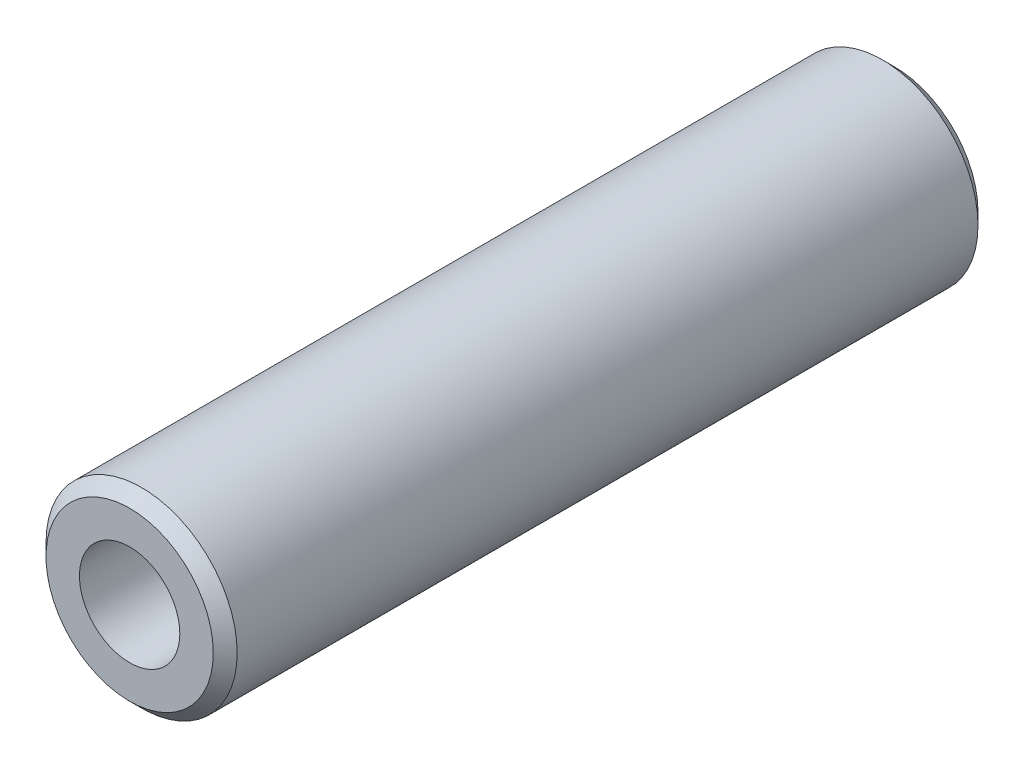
ISO-10303-21;
HEADER;
FILE_DESCRIPTION(('STEP AP214'),'2;1');
FILE_NAME('part.step','',(''),(''),'','','');
FILE_SCHEMA(('AUTOMOTIVE_DESIGN { 1 0 10303 214 1 1 1 1 }'));
ENDSEC;
DATA;
#1=APPLICATION_CONTEXT('core data for automotive mechanical design processes');
#2=APPLICATION_PROTOCOL_DEFINITION('international standard','automotive_design',2000,#1);
#3=PRODUCT_CONTEXT('',#1,'mechanical');
#4=PRODUCT('Part','Part','',(#3));
#5=PRODUCT_RELATED_PRODUCT_CATEGORY('part','',(#4));
#6=PRODUCT_DEFINITION_FORMATION('','',#4);
#7=PRODUCT_DEFINITION_CONTEXT('part definition',#1,'design');
#8=PRODUCT_DEFINITION('design','',#6,#7);
#9=PRODUCT_DEFINITION_SHAPE('','',#8);
#10=(LENGTH_UNIT() NAMED_UNIT(*) SI_UNIT(.MILLI.,.METRE.));
#11=(NAMED_UNIT(*) PLANE_ANGLE_UNIT() SI_UNIT($,.RADIAN.));
#12=(NAMED_UNIT(*) SI_UNIT($,.STERADIAN.) SOLID_ANGLE_UNIT());
#13=UNCERTAINTY_MEASURE_WITH_UNIT(LENGTH_MEASURE(1.E-05),#10,'distance_accuracy_value','');
#14=(GEOMETRIC_REPRESENTATION_CONTEXT(3) GLOBAL_UNCERTAINTY_ASSIGNED_CONTEXT((#13)) GLOBAL_UNIT_ASSIGNED_CONTEXT((#10,
#11,#12)) REPRESENTATION_CONTEXT('',''));
#15=CARTESIAN_POINT('',(0.,0.,0.));
#16=DIRECTION('',(0.,0.,1.));
#17=DIRECTION('',(1.,0.,0.));
#18=AXIS2_PLACEMENT_3D('',#15,#16,#17);
#19=CARTESIAN_POINT('',(0.,0.,16.));
#20=DIRECTION('',(0.,0.,-1.));
#21=DIRECTION('',(-1.,0.,0.));
#22=AXIS2_PLACEMENT_3D('',#19,#20,#21);
#23=CYLINDRICAL_SURFACE('',#22,4.);
#24=CARTESIAN_POINT('',(0.,0.,-15.5));
#25=DIRECTION('',(0.,0.,1.));
#26=DIRECTION('',(1.,0.,0.));
#27=AXIS2_PLACEMENT_3D('',#24,#25,#26);
#28=CIRCLE('',#27,4.);
#29=CARTESIAN_POINT('',(4.00000000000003,0.,-15.5));
#30=VERTEX_POINT('',#29);
#31=EDGE_CURVE('E56',#30,#30,#28,.T.);
#32=ORIENTED_EDGE('',*,*,#31,.T.);
#33=EDGE_LOOP('',(#32));
#34=FACE_BOUND('',#33,.T.);
#35=CARTESIAN_POINT('',(0.,0.,15.5));
#36=DIRECTION('',(0.,0.,1.));
#37=DIRECTION('',(1.,0.,0.));
#38=AXIS2_PLACEMENT_3D('',#35,#36,#37);
#39=CIRCLE('',#38,4.);
#40=CARTESIAN_POINT('',(4.,0.,15.5));
#41=VERTEX_POINT('',#40);
#42=EDGE_CURVE('E51',#41,#41,#39,.F.);
#43=ORIENTED_EDGE('',*,*,#42,.T.);
#44=EDGE_LOOP('',(#43));
#45=FACE_BOUND('',#44,.T.);
#46=ADVANCED_FACE('F30',(#34,#45),#23,.T.);
#47=CARTESIAN_POINT('',(0.,0.,16.));
#48=DIRECTION('',(0.,0.,1.));
#49=DIRECTION('',(1.,0.,0.));
#50=AXIS2_PLACEMENT_3D('',#47,#48,#49);
#51=PLANE('',#50);
#52=CARTESIAN_POINT('',(0.,0.,16.));
#53=DIRECTION('',(0.,0.,1.));
#54=DIRECTION('',(1.,0.,0.));
#55=AXIS2_PLACEMENT_3D('',#52,#53,#54);
#56=CIRCLE('',#55,2.1);
#57=CARTESIAN_POINT('',(2.1,0.,16.));
#58=VERTEX_POINT('',#57);
#59=EDGE_CURVE('E48',#58,#58,#56,.T.);
#60=ORIENTED_EDGE('',*,*,#59,.F.);
#61=EDGE_LOOP('',(#60));
#62=FACE_BOUND('',#61,.T.);
#63=CARTESIAN_POINT('',(0.,0.,16.));
#64=DIRECTION('',(0.,0.,1.));
#65=DIRECTION('',(1.,0.,0.));
#66=AXIS2_PLACEMENT_3D('',#63,#64,#65);
#67=CIRCLE('',#66,3.5);
#68=CARTESIAN_POINT('',(3.5,0.,16.));
#69=VERTEX_POINT('',#68);
#70=EDGE_CURVE('E11',#69,#69,#67,.T.);
#71=ORIENTED_EDGE('',*,*,#70,.T.);
#72=EDGE_LOOP('',(#71));
#73=FACE_BOUND('',#72,.T.);
#74=ADVANCED_FACE('F72',(#62,#73),#51,.T.);
#75=CARTESIAN_POINT('',(0.,0.,-16.));
#76=DIRECTION('',(0.,0.,1.));
#77=DIRECTION('',(1.,0.,0.));
#78=AXIS2_PLACEMENT_3D('',#75,#76,#77);
#79=PLANE('',#78);
#80=CARTESIAN_POINT('',(0.,0.,-16.));
#81=DIRECTION('',(0.,0.,1.));
#82=DIRECTION('',(1.,0.,0.));
#83=AXIS2_PLACEMENT_3D('',#80,#81,#82);
#84=CIRCLE('',#83,3.5);
#85=CARTESIAN_POINT('',(3.50000000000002,0.,-16.));
#86=VERTEX_POINT('',#85);
#87=EDGE_CURVE('E36',#86,#86,#84,.F.);
#88=ORIENTED_EDGE('',*,*,#87,.T.);
#89=EDGE_LOOP('',(#88));
#90=FACE_BOUND('',#89,.T.);
#91=ADVANCED_FACE('F61',(#90),#79,.F.);
#92=CARTESIAN_POINT('',(0.,0.,-15.5));
#93=DIRECTION('',(0.,0.,1.));
#94=DIRECTION('',(1.,0.,0.));
#95=AXIS2_PLACEMENT_3D('',#92,#93,#94);
#96=CONICAL_SURFACE('',#95,4.,0.785398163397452);
#97=ORIENTED_EDGE('',*,*,#87,.F.);
#98=EDGE_LOOP('',(#97));
#99=FACE_BOUND('',#98,.T.);
#100=ORIENTED_EDGE('',*,*,#31,.F.);
#101=EDGE_LOOP('',(#100));
#102=FACE_BOUND('',#101,.T.);
#103=ADVANCED_FACE('F63',(#99,#102),#96,.T.);
#104=CARTESIAN_POINT('',(0.,0.,16.));
#105=DIRECTION('',(0.,0.,-1.));
#106=DIRECTION('',(-1.,0.,0.));
#107=AXIS2_PLACEMENT_3D('',#104,#105,#106);
#108=CONICAL_SURFACE('',#107,3.5,0.785398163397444);
#109=ORIENTED_EDGE('',*,*,#42,.F.);
#110=EDGE_LOOP('',(#109));
#111=FACE_BOUND('',#110,.T.);
#112=ORIENTED_EDGE('',*,*,#70,.F.);
#113=EDGE_LOOP('',(#112));
#114=FACE_BOUND('',#113,.T.);
#115=ADVANCED_FACE('F66',(#111,#114),#108,.T.);
#116=CARTESIAN_POINT('',(0.,0.,16.));
#117=DIRECTION('',(0.,0.,1.));
#118=DIRECTION('',(1.,0.,0.));
#119=AXIS2_PLACEMENT_3D('',#116,#117,#118);
#120=CYLINDRICAL_SURFACE('',#119,2.1);
#121=CARTESIAN_POINT('',(0.,0.,5.6));
#122=DIRECTION('',(0.,0.,1.));
#123=DIRECTION('',(1.,0.,0.));
#124=AXIS2_PLACEMENT_3D('',#121,#122,#123);
#125=CIRCLE('',#124,2.1);
#126=CARTESIAN_POINT('',(2.1,0.,5.6));
#127=VERTEX_POINT('',#126);
#128=EDGE_CURVE('E46',#127,#127,#125,.T.);
#129=ORIENTED_EDGE('',*,*,#128,.F.);
#130=EDGE_LOOP('',(#129));
#131=FACE_BOUND('',#130,.T.);
#132=ORIENTED_EDGE('',*,*,#59,.T.);
#133=EDGE_LOOP('',(#132));
#134=FACE_BOUND('',#133,.T.);
#135=ADVANCED_FACE('F42',(#131,#134),#120,.F.);
#136=CARTESIAN_POINT('',(0.,0.,5.6));
#137=DIRECTION('',(0.,0.,1.));
#138=DIRECTION('',(1.,0.,0.));
#139=AXIS2_PLACEMENT_3D('',#136,#137,#138);
#140=CONICAL_SURFACE('',#139,2.1,1.02974425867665);
#141=CARTESIAN_POINT('',(0.,0.,4.33819270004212));
#142=VERTEX_POINT('',#141);
#143=VERTEX_LOOP('',#142);
#144=FACE_BOUND('',#143,.T.);
#145=ORIENTED_EDGE('',*,*,#128,.T.);
#146=EDGE_LOOP('',(#145));
#147=FACE_BOUND('',#146,.T.);
#148=ADVANCED_FACE('F39',(#144,#147),#140,.F.);
#149=CLOSED_SHELL('',(#46,#74,#91,#103,#115,#135,#148));
#150=MANIFOLD_SOLID_BREP('B2',#149);
#151=ADVANCED_BREP_SHAPE_REPRESENTATION('',(#18,#150),#14);
#152=SHAPE_DEFINITION_REPRESENTATION(#9,#151);
ENDSEC;
END-ISO-10303-21;
